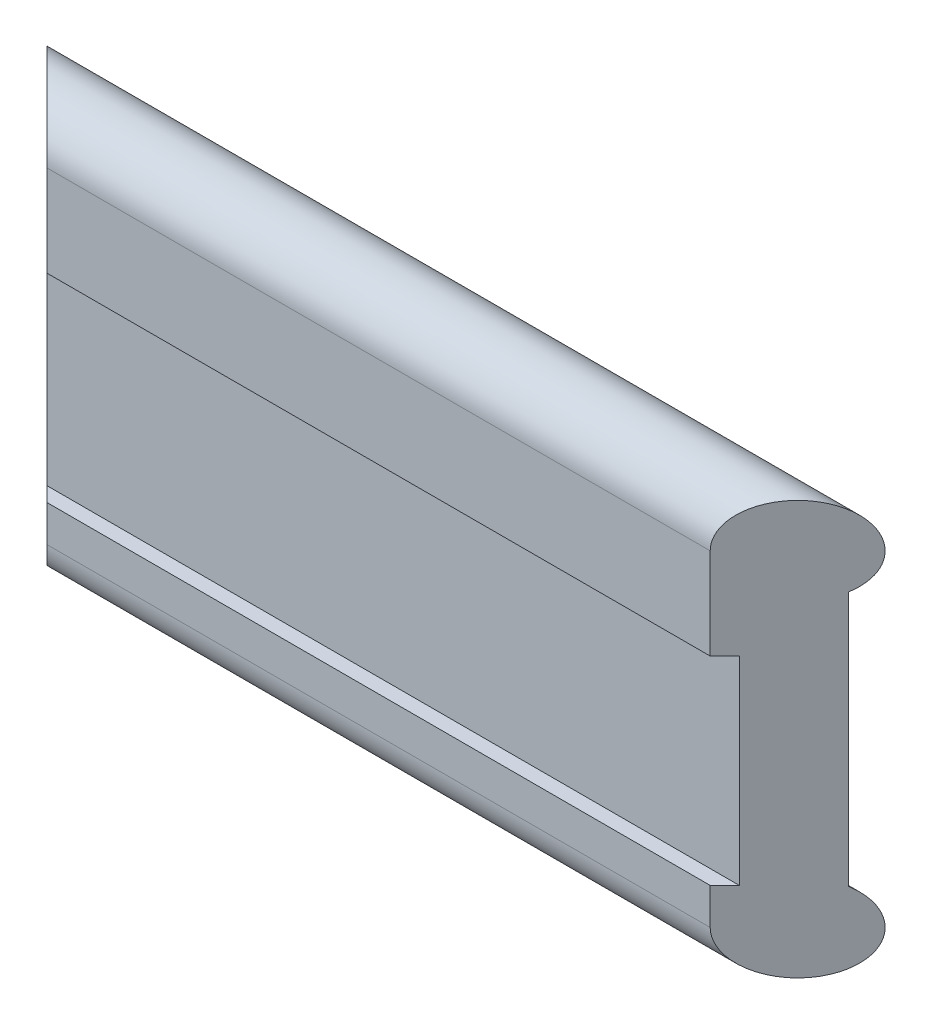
from build123d import *

# Parameters (mm, degrees)
SKETCH1_W               = 230
SKETCH1_H               = 54.5
BOSS_EXTRUDE1_DEPTH     = 15
BOSS_EXTRUDE2_DEPTH     = 230
CUT_EXTRUDE1_DEPTH      = 134.094186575
CUT_EXTRUDE1_DEPTH_BACK = 134.094186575


with BuildPart() as part:
    # Sketch1 → Boss-Extrude1 (new body)
    with BuildSketch(Plane.XY):
        Rectangle(SKETCH1_W, SKETCH1_H)
    extrude(amount=BOSS_EXTRUDE1_DEPTH)

    # Sketch2 → Boss-Extrude2 (add)
    with BuildSketch(Plane.ZY.offset(115)):
        with BuildLine():
            Line((15, 27.25), (19, 27.25))
            Line((19, 27.25), (19, 52.25))
            ThreePointArc((19, 52.25), (1.522774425, 62.927078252), (0, 42.503205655))
            Line((0, 42.503205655), (0, 27.25))
            Line((0, 27.25), (15, 27.25))
        make_face()
        with BuildLine():
            Line((0, -27.25), (15, -27.25))
            Line((15, -27.25), (19, -27.25))
            Line((19, -27.25), (19, -37.25))
            ThreePointArc((19, -37.25), (1.522774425, -47.927078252), (0, -27.503205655))
            Line((0, -27.503205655), (0, -27.25))
        make_face()
    extrude(amount=-BOSS_EXTRUDE2_DEPTH)

    # Sketch3 → Cut-Extrude1 (cut, two sides: drawn at the far end of the back side and taken through both)
    with BuildSketch(Plane(origin=(0, 0, 0), x_dir=(1, 0, 0), z_dir=(0, 1, 0)).offset(-CUT_EXTRUDE1_DEPTH_BACK)):
        Polygon((-115, 5), (-91, -19), (0, -19), (91, -19), (115, 5), (115, -29), (-115, -29), align=None)
    extrude(amount=CUT_EXTRUDE1_DEPTH + CUT_EXTRUDE1_DEPTH_BACK, mode=Mode.SUBTRACT)


solid = part.part
